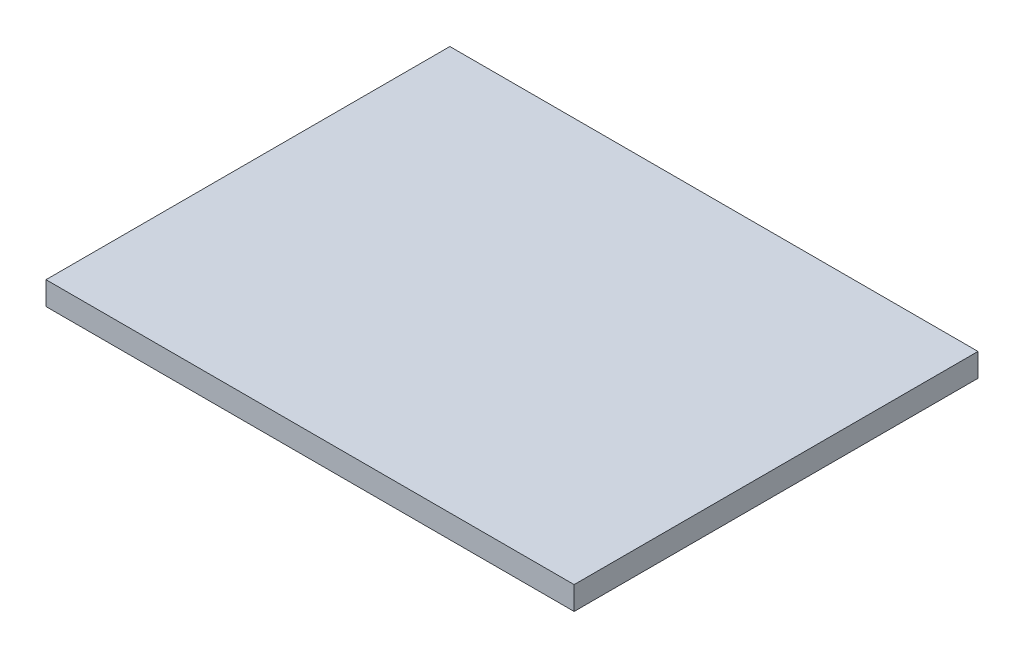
from build123d import *

# Parameters (mm, degrees)
SKETCH1_W           = 107.95
SKETCH1_H           = 82.55
BOSS_EXTRUDE1_DEPTH = 4.7625


with BuildPart() as part:
    # Sketch1 → Boss-Extrude1 (new body)
    with BuildSketch(Plane(origin=(0, 0, 0), x_dir=(1, 0, 0), z_dir=(0, 1, 0))):
        Rectangle(SKETCH1_W, SKETCH1_H)
    extrude(amount=BOSS_EXTRUDE1_DEPTH)


solid = part.part
